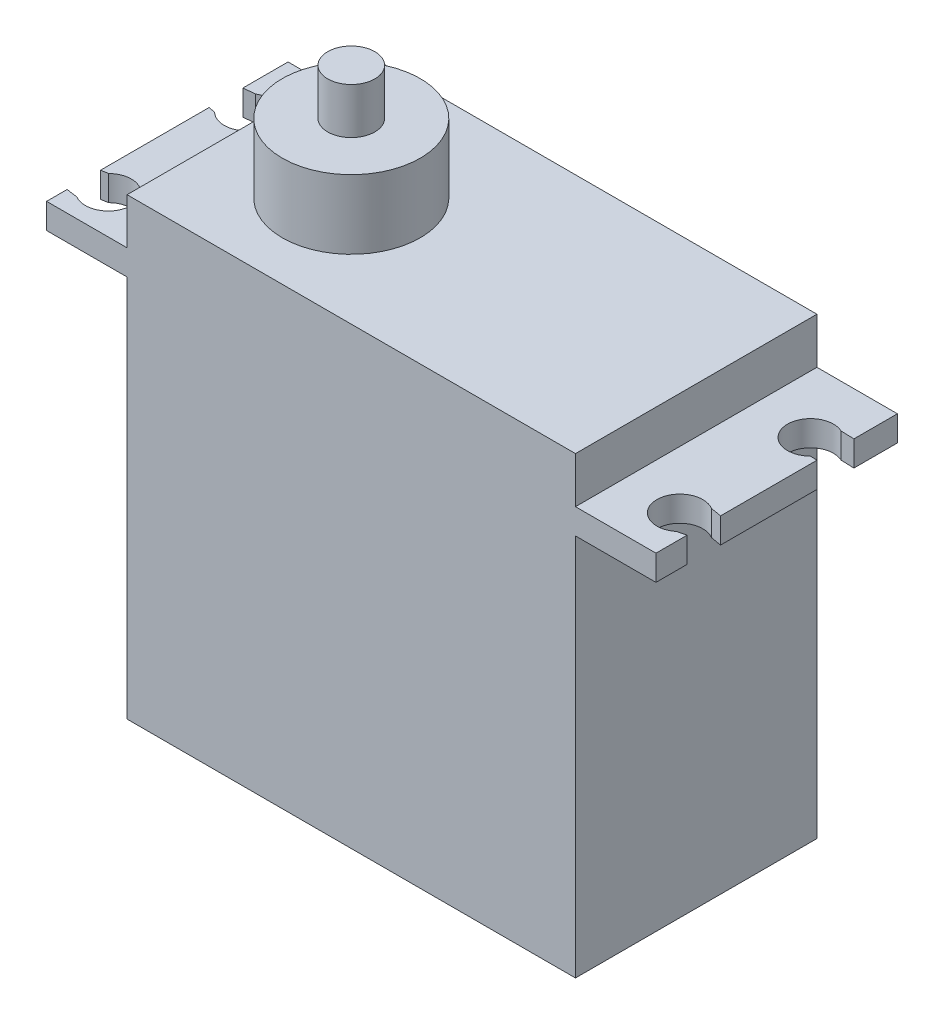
from build123d import *

# Parameters (mm, degrees)
SKETCH1_W                = 39
SKETCH1_H                = 21
BOSS_EXTRUDE1_DEPTH      = 39.5
BOSS_EXTRUDE2_DEPTH      = 7
BOSS_EXTRUDE2_DEPTH_BACK = 46
SKETCH2_W                = 21
SKETCH2_H                = 2.2
CUT_EXTRUDE3_DEPTH       = 7
SKETCH5_R                = 2.051313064
BOSS_EXTRUDE4_DEPTH      = 10
SKETCH4_R                = 6
BOSS_EXTRUDE5_DEPTH      = 6


with BuildPart() as part:
    # Sketch1 → Boss-Extrude1 (new body)
    with BuildSketch(Plane(origin=(0, 0, 0), x_dir=(1, 0, 0), z_dir=(0, 1, 0))):
        with Locations((4.319620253, 2.045886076)):
            Rectangle(SKETCH1_W, SKETCH1_H)
    extrude(amount=BOSS_EXTRUDE1_DEPTH)

    # Sketch2 → Boss-Extrude2 (add, two sides: drawn at the far end of the back side and taken through both)
    with BuildSketch(Plane(origin=(23.819620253, 0, 0), x_dir=(0, 0, -1), z_dir=(1, 0, 0)).offset(-BOSS_EXTRUDE2_DEPTH_BACK)):
        with Locations((2.045886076, 34.4)):
            Rectangle(SKETCH2_W, SKETCH2_H)
    extrude(amount=BOSS_EXTRUDE2_DEPTH + BOSS_EXTRUDE2_DEPTH_BACK)

    # Sketch3 → Cut-Extrude3 (cut)
    with BuildSketch(Plane(origin=(0, 35.5, 0), x_dir=(1, 0, 0), z_dir=(0, 1, 0))):
        with BuildLine():
            Line((30.219682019, 5.560743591), (32.229671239, 5.560743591))
            Line((32.229671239, 5.560743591), (32.229671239, 8.714246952))
            Line((32.229671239, 8.714246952), (29.667466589, 8.800365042))
            ThreePointArc((29.667466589, 8.800365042), (26.84805755, 6.652902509), (30.219682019, 5.560743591))
        make_face()
        with BuildLine():
            Line((32.858489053, -3.195881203), (29.854325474, -2.665891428))
            ThreePointArc((29.854325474, -2.665891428), (26.824509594, -4.517198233), (30.08284416, -5.92800545))
            Line((30.08284416, -5.92800545), (32.858489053, -5.208809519))
            Line((32.858489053, -5.208809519), (32.858489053, -3.195881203))
        make_face()
        with BuildLine():
            Line((-25.609138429, 8.308277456), (-25.609138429, 6.402818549))
            Line((-25.609138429, 6.402818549), (-21.580441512, 5.560743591))
            ThreePointArc((-21.580441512, 5.560743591), (-18.195380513, 6.74447325), (-21.192019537, 8.714246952))
            Line((-21.192019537, 8.714246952), (-25.609138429, 8.308277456))
        make_face()
        with BuildLine():
            Line((-21.580441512, -3.655597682), (-25.609138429, -4.377436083))
            Line((-25.609138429, -4.377436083), (-25.609138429, -6.17119986))
            Line((-25.609138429, -6.17119986), (-21.192019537, -6.809101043))
            ThreePointArc((-21.192019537, -6.809101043), (-18.195380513, -4.839327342), (-21.580441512, -3.655597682))
        make_face()
    extrude(amount=-CUT_EXTRUDE3_DEPTH, mode=Mode.SUBTRACT)

    # Sketch5 → Boss-Extrude4 (add)
    with BuildSketch(Plane(origin=(0, 39.5, 0), x_dir=(1, 0, 0), z_dir=(0, 1, 0))):
        with Locations(Location((-5.180379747, 1.045886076, 0), (0, 0, 270))):
            Circle(SKETCH5_R)
    extrude(amount=BOSS_EXTRUDE4_DEPTH)

    # Sketch4 → Boss-Extrude5 (add)
    with BuildSketch(Plane(origin=(0, 39.5, 0), x_dir=(1, 0, 0), z_dir=(0, 1, 0))):
        with Locations(Location((-5.180379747, 1.045886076, 0), (0, 0, 270))):
            Circle(SKETCH4_R)
    extrude(amount=BOSS_EXTRUDE5_DEPTH)


solid = part.part
